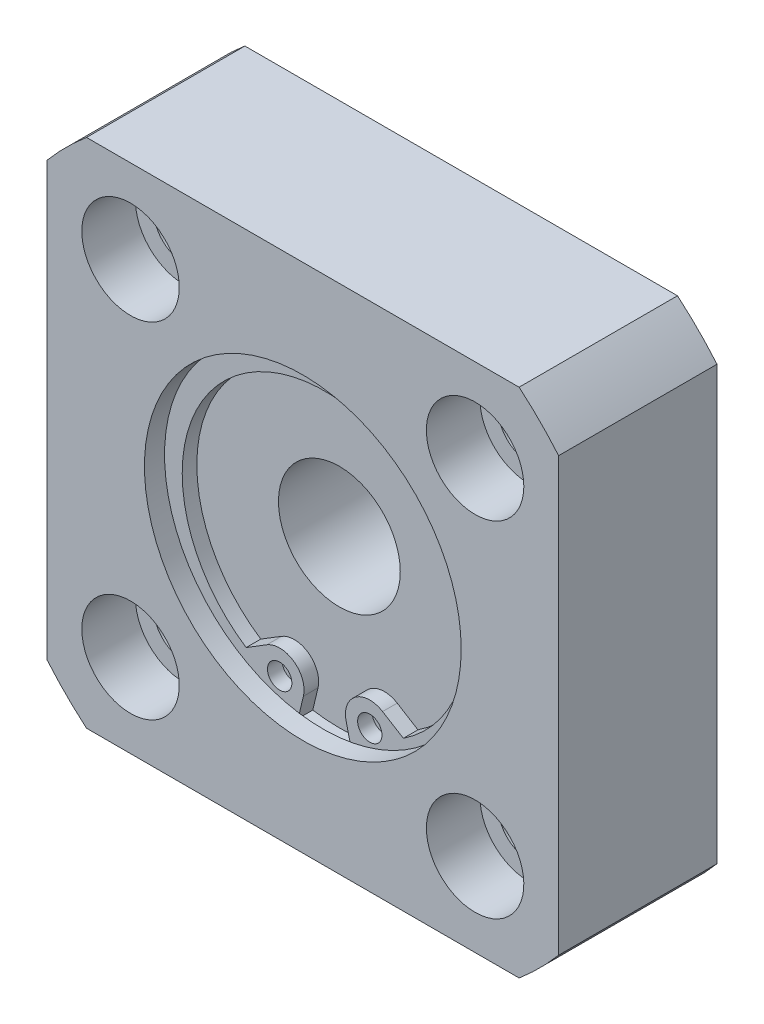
ISO-10303-21;
HEADER;
FILE_DESCRIPTION(('STEP AP214'),'2;1');
FILE_NAME('part.step','',(''),(''),'','','');
FILE_SCHEMA(('AUTOMOTIVE_DESIGN { 1 0 10303 214 1 1 1 1 }'));
ENDSEC;
DATA;
#1=APPLICATION_CONTEXT('core data for automotive mechanical design processes');
#2=APPLICATION_PROTOCOL_DEFINITION('international standard','automotive_design',2000,#1);
#3=PRODUCT_CONTEXT('',#1,'mechanical');
#4=PRODUCT('Part','Part','',(#3));
#5=PRODUCT_RELATED_PRODUCT_CATEGORY('part','',(#4));
#6=PRODUCT_DEFINITION_FORMATION('','',#4);
#7=PRODUCT_DEFINITION_CONTEXT('part definition',#1,'design');
#8=PRODUCT_DEFINITION('design','',#6,#7);
#9=PRODUCT_DEFINITION_SHAPE('','',#8);
#10=(LENGTH_UNIT() NAMED_UNIT(*) SI_UNIT(.MILLI.,.METRE.));
#11=(NAMED_UNIT(*) PLANE_ANGLE_UNIT() SI_UNIT($,.RADIAN.));
#12=(NAMED_UNIT(*) SI_UNIT($,.STERADIAN.) SOLID_ANGLE_UNIT());
#13=UNCERTAINTY_MEASURE_WITH_UNIT(LENGTH_MEASURE(1.E-05),#10,'distance_accuracy_value','');
#14=(GEOMETRIC_REPRESENTATION_CONTEXT(3) GLOBAL_UNCERTAINTY_ASSIGNED_CONTEXT((#13)) GLOBAL_UNIT_ASSIGNED_CONTEXT((#10,
#11,#12)) REPRESENTATION_CONTEXT('',''));
#15=CARTESIAN_POINT('',(0.,0.,0.));
#16=DIRECTION('',(0.,0.,1.));
#17=DIRECTION('',(1.,0.,0.));
#18=AXIS2_PLACEMENT_3D('',#15,#16,#17);
#19=CARTESIAN_POINT('',(14.1421356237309,14.142135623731,0.));
#20=DIRECTION('',(0.,0.,1.));
#21=DIRECTION('',(1.,0.,0.));
#22=AXIS2_PLACEMENT_3D('',#19,#20,#21);
#23=CYLINDRICAL_SURFACE('',#22,2.5);
#24=CARTESIAN_POINT('',(14.1421356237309,14.142135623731,0.));
#25=DIRECTION('',(0.,0.,1.));
#26=DIRECTION('',(1.,0.,0.));
#27=AXIS2_PLACEMENT_3D('',#24,#25,#26);
#28=CIRCLE('',#27,2.5);
#29=CARTESIAN_POINT('',(16.6421356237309,14.142135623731,0.));
#30=VERTEX_POINT('',#29);
#31=EDGE_CURVE('E203',#30,#30,#28,.T.);
#32=ORIENTED_EDGE('',*,*,#31,.F.);
#33=EDGE_LOOP('',(#32));
#34=FACE_BOUND('',#33,.T.);
#35=CARTESIAN_POINT('',(14.1421356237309,14.142135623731,8.6));
#36=DIRECTION('',(0.,0.,1.));
#37=DIRECTION('',(1.,0.,0.));
#38=AXIS2_PLACEMENT_3D('',#35,#36,#37);
#39=CIRCLE('',#38,2.5);
#40=CARTESIAN_POINT('',(16.6421356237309,14.142135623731,8.6));
#41=VERTEX_POINT('',#40);
#42=EDGE_CURVE('E200',#41,#41,#39,.F.);
#43=ORIENTED_EDGE('',*,*,#42,.F.);
#44=EDGE_LOOP('',(#43));
#45=FACE_BOUND('',#44,.T.);
#46=ADVANCED_FACE('F14',(#34,#45),#23,.F.);
#47=CARTESIAN_POINT('',(14.142135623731,-14.1421356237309,0.));
#48=DIRECTION('',(0.,0.,1.));
#49=DIRECTION('',(1.,0.,0.));
#50=AXIS2_PLACEMENT_3D('',#47,#48,#49);
#51=CYLINDRICAL_SURFACE('',#50,2.5);
#52=CARTESIAN_POINT('',(14.142135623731,-14.1421356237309,0.));
#53=DIRECTION('',(0.,0.,1.));
#54=DIRECTION('',(0.,-1.,0.));
#55=AXIS2_PLACEMENT_3D('',#52,#53,#54);
#56=CIRCLE('',#55,2.5);
#57=CARTESIAN_POINT('',(14.142135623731,-16.6421356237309,0.));
#58=VERTEX_POINT('',#57);
#59=EDGE_CURVE('E275',#58,#58,#56,.T.);
#60=ORIENTED_EDGE('',*,*,#59,.F.);
#61=EDGE_LOOP('',(#60));
#62=FACE_BOUND('',#61,.T.);
#63=CARTESIAN_POINT('',(14.142135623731,-14.1421356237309,8.6));
#64=DIRECTION('',(0.,0.,1.));
#65=DIRECTION('',(1.,0.,0.));
#66=AXIS2_PLACEMENT_3D('',#63,#64,#65);
#67=CIRCLE('',#66,2.5);
#68=CARTESIAN_POINT('',(16.642135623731,-14.1421356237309,8.6));
#69=VERTEX_POINT('',#68);
#70=EDGE_CURVE('E195',#69,#69,#67,.F.);
#71=ORIENTED_EDGE('',*,*,#70,.F.);
#72=EDGE_LOOP('',(#71));
#73=FACE_BOUND('',#72,.T.);
#74=ADVANCED_FACE('F419',(#62,#73),#51,.F.);
#75=CARTESIAN_POINT('',(-14.142135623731,-14.1421356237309,0.));
#76=DIRECTION('',(0.,0.,1.));
#77=DIRECTION('',(1.,0.,0.));
#78=AXIS2_PLACEMENT_3D('',#75,#76,#77);
#79=CYLINDRICAL_SURFACE('',#78,2.5);
#80=CARTESIAN_POINT('',(-14.142135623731,-14.1421356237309,0.));
#81=DIRECTION('',(0.,0.,1.));
#82=DIRECTION('',(-1.,0.,0.));
#83=AXIS2_PLACEMENT_3D('',#80,#81,#82);
#84=CIRCLE('',#83,2.5);
#85=CARTESIAN_POINT('',(-16.642135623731,-14.1421356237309,0.));
#86=VERTEX_POINT('',#85);
#87=EDGE_CURVE('E278',#86,#86,#84,.T.);
#88=ORIENTED_EDGE('',*,*,#87,.F.);
#89=EDGE_LOOP('',(#88));
#90=FACE_BOUND('',#89,.T.);
#91=CARTESIAN_POINT('',(-14.142135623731,-14.1421356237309,8.6));
#92=DIRECTION('',(0.,0.,1.));
#93=DIRECTION('',(1.,0.,0.));
#94=AXIS2_PLACEMENT_3D('',#91,#92,#93);
#95=CIRCLE('',#94,2.5);
#96=CARTESIAN_POINT('',(-11.642135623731,-14.1421356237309,8.6));
#97=VERTEX_POINT('',#96);
#98=EDGE_CURVE('E190',#97,#97,#95,.F.);
#99=ORIENTED_EDGE('',*,*,#98,.F.);
#100=EDGE_LOOP('',(#99));
#101=FACE_BOUND('',#100,.T.);
#102=ADVANCED_FACE('F425',(#90,#101),#79,.F.);
#103=CARTESIAN_POINT('',(-14.1421356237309,14.142135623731,0.));
#104=DIRECTION('',(0.,0.,1.));
#105=DIRECTION('',(1.,0.,0.));
#106=AXIS2_PLACEMENT_3D('',#103,#104,#105);
#107=CYLINDRICAL_SURFACE('',#106,2.5);
#108=CARTESIAN_POINT('',(-14.1421356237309,14.142135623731,0.));
#109=DIRECTION('',(0.,0.,1.));
#110=DIRECTION('',(0.,1.,0.));
#111=AXIS2_PLACEMENT_3D('',#108,#109,#110);
#112=CIRCLE('',#111,2.5);
#113=CARTESIAN_POINT('',(-14.1421356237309,16.642135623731,0.));
#114=VERTEX_POINT('',#113);
#115=EDGE_CURVE('E198',#114,#114,#112,.T.);
#116=ORIENTED_EDGE('',*,*,#115,.F.);
#117=EDGE_LOOP('',(#116));
#118=FACE_BOUND('',#117,.T.);
#119=CARTESIAN_POINT('',(-14.1421356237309,14.142135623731,8.6));
#120=DIRECTION('',(0.,0.,1.));
#121=DIRECTION('',(1.,0.,0.));
#122=AXIS2_PLACEMENT_3D('',#119,#120,#121);
#123=CIRCLE('',#122,2.5);
#124=CARTESIAN_POINT('',(-11.6421356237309,14.142135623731,8.6));
#125=VERTEX_POINT('',#124);
#126=EDGE_CURVE('E185',#125,#125,#123,.F.);
#127=ORIENTED_EDGE('',*,*,#126,.F.);
#128=EDGE_LOOP('',(#127));
#129=FACE_BOUND('',#128,.T.);
#130=ADVANCED_FACE('F531',(#118,#129),#107,.F.);
#131=CARTESIAN_POINT('',(14.1421356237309,14.142135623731,8.6));
#132=DIRECTION('',(0.,0.,1.));
#133=DIRECTION('',(1.,0.,0.));
#134=AXIS2_PLACEMENT_3D('',#131,#132,#133);
#135=PLANE('',#134);
#136=CARTESIAN_POINT('',(14.1421356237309,14.142135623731,8.6));
#137=DIRECTION('',(0.,0.,1.));
#138=DIRECTION('',(1.,0.,0.));
#139=AXIS2_PLACEMENT_3D('',#136,#137,#138);
#140=CIRCLE('',#139,4.);
#141=CARTESIAN_POINT('',(18.1421356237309,14.142135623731,8.6));
#142=VERTEX_POINT('',#141);
#143=EDGE_CURVE('E204',#142,#142,#140,.T.);
#144=ORIENTED_EDGE('',*,*,#143,.T.);
#145=EDGE_LOOP('',(#144));
#146=FACE_BOUND('',#145,.T.);
#147=ORIENTED_EDGE('',*,*,#42,.T.);
#148=EDGE_LOOP('',(#147));
#149=FACE_BOUND('',#148,.T.);
#150=ADVANCED_FACE('F526',(#146,#149),#135,.T.);
#151=CARTESIAN_POINT('',(14.142135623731,-14.1421356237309,8.6));
#152=DIRECTION('',(0.,0.,1.));
#153=DIRECTION('',(1.,0.,0.));
#154=AXIS2_PLACEMENT_3D('',#151,#152,#153);
#155=PLANE('',#154);
#156=CARTESIAN_POINT('',(14.142135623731,-14.1421356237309,8.6));
#157=DIRECTION('',(0.,0.,1.));
#158=DIRECTION('',(0.,-1.,0.));
#159=AXIS2_PLACEMENT_3D('',#156,#157,#158);
#160=CIRCLE('',#159,4.);
#161=CARTESIAN_POINT('',(14.142135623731,-18.1421356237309,8.6));
#162=VERTEX_POINT('',#161);
#163=EDGE_CURVE('E199',#162,#162,#160,.T.);
#164=ORIENTED_EDGE('',*,*,#163,.T.);
#165=EDGE_LOOP('',(#164));
#166=FACE_BOUND('',#165,.T.);
#167=ORIENTED_EDGE('',*,*,#70,.T.);
#168=EDGE_LOOP('',(#167));
#169=FACE_BOUND('',#168,.T.);
#170=ADVANCED_FACE('F518',(#166,#169),#155,.T.);
#171=CARTESIAN_POINT('',(-14.142135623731,-14.1421356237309,8.6));
#172=DIRECTION('',(0.,0.,1.));
#173=DIRECTION('',(1.,0.,0.));
#174=AXIS2_PLACEMENT_3D('',#171,#172,#173);
#175=PLANE('',#174);
#176=CARTESIAN_POINT('',(-14.142135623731,-14.1421356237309,8.6));
#177=DIRECTION('',(0.,0.,1.));
#178=DIRECTION('',(-1.,0.,0.));
#179=AXIS2_PLACEMENT_3D('',#176,#177,#178);
#180=CIRCLE('',#179,4.);
#181=CARTESIAN_POINT('',(-18.142135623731,-14.1421356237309,8.6));
#182=VERTEX_POINT('',#181);
#183=EDGE_CURVE('E194',#182,#182,#180,.T.);
#184=ORIENTED_EDGE('',*,*,#183,.T.);
#185=EDGE_LOOP('',(#184));
#186=FACE_BOUND('',#185,.T.);
#187=ORIENTED_EDGE('',*,*,#98,.T.);
#188=EDGE_LOOP('',(#187));
#189=FACE_BOUND('',#188,.T.);
#190=ADVANCED_FACE('F510',(#186,#189),#175,.T.);
#191=CARTESIAN_POINT('',(-14.1421356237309,14.142135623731,8.6));
#192=DIRECTION('',(0.,0.,1.));
#193=DIRECTION('',(1.,0.,0.));
#194=AXIS2_PLACEMENT_3D('',#191,#192,#193);
#195=PLANE('',#194);
#196=CARTESIAN_POINT('',(-14.1421356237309,14.142135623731,8.6));
#197=DIRECTION('',(0.,0.,1.));
#198=DIRECTION('',(0.,1.,0.));
#199=AXIS2_PLACEMENT_3D('',#196,#197,#198);
#200=CIRCLE('',#199,4.);
#201=CARTESIAN_POINT('',(-14.1421356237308,18.142135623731,8.6));
#202=VERTEX_POINT('',#201);
#203=EDGE_CURVE('E189',#202,#202,#200,.T.);
#204=ORIENTED_EDGE('',*,*,#203,.T.);
#205=EDGE_LOOP('',(#204));
#206=FACE_BOUND('',#205,.T.);
#207=ORIENTED_EDGE('',*,*,#126,.T.);
#208=EDGE_LOOP('',(#207));
#209=FACE_BOUND('',#208,.T.);
#210=ADVANCED_FACE('F440',(#206,#209),#195,.T.);
#211=CARTESIAN_POINT('',(0.,0.,0.));
#212=DIRECTION('',(0.,0.,-1.));
#213=DIRECTION('',(-1.,0.,0.));
#214=AXIS2_PLACEMENT_3D('',#211,#212,#213);
#215=PLANE('',#214);
#216=CARTESIAN_POINT('',(0.,0.,0.));
#217=DIRECTION('',(0.,0.,-1.));
#218=DIRECTION('',(-1.,0.,0.));
#219=AXIS2_PLACEMENT_3D('',#216,#217,#218);
#220=CIRCLE('',#219,11.);
#221=CARTESIAN_POINT('',(-11.,0.,0.));
#222=VERTEX_POINT('',#221);
#223=EDGE_CURVE('E174',#222,#222,#220,.T.);
#224=ORIENTED_EDGE('',*,*,#223,.F.);
#225=EDGE_LOOP('',(#224));
#226=FACE_BOUND('',#225,.T.);
#227=ORIENTED_EDGE('',*,*,#115,.T.);
#228=EDGE_LOOP('',(#227));
#229=FACE_BOUND('',#228,.T.);
#230=ORIENTED_EDGE('',*,*,#87,.T.);
#231=EDGE_LOOP('',(#230));
#232=FACE_BOUND('',#231,.T.);
#233=ORIENTED_EDGE('',*,*,#59,.T.);
#234=EDGE_LOOP('',(#233));
#235=FACE_BOUND('',#234,.T.);
#236=ORIENTED_EDGE('',*,*,#31,.T.);
#237=EDGE_LOOP('',(#236));
#238=FACE_BOUND('',#237,.T.);
#239=CARTESIAN_POINT('',(0.,0.,0.));
#240=DIRECTION('',(0.,0.,-1.));
#241=DIRECTION('',(-1.,0.,0.));
#242=AXIS2_PLACEMENT_3D('',#239,#240,#241);
#243=CIRCLE('',#242,27.5);
#244=CARTESIAN_POINT('',(21.,-17.7552809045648,0.));
#245=VERTEX_POINT('',#244);
#246=CARTESIAN_POINT('',(17.7552809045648,-21.,0.));
#247=VERTEX_POINT('',#246);
#248=EDGE_CURVE('E262',#245,#247,#243,.T.);
#249=ORIENTED_EDGE('',*,*,#248,.T.);
#250=DIRECTION('',(1.,0.,0.));
#251=VECTOR('',#250,1.);
#252=CARTESIAN_POINT('',(-17.7552809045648,-21.,0.));
#253=LINE('',#252,#251);
#254=CARTESIAN_POINT('',(-17.7552809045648,-21.,0.));
#255=VERTEX_POINT('',#254);
#256=EDGE_CURVE('E265',#255,#247,#253,.T.);
#257=ORIENTED_EDGE('',*,*,#256,.F.);
#258=CARTESIAN_POINT('',(0.,0.,0.));
#259=DIRECTION('',(0.,0.,1.));
#260=DIRECTION('',(1.,0.,0.));
#261=AXIS2_PLACEMENT_3D('',#258,#259,#260);
#262=CIRCLE('',#261,27.5);
#263=CARTESIAN_POINT('',(-21.,-17.7552809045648,0.));
#264=VERTEX_POINT('',#263);
#265=EDGE_CURVE('E255',#264,#255,#262,.T.);
#266=ORIENTED_EDGE('',*,*,#265,.F.);
#267=DIRECTION('',(0.,1.,0.));
#268=VECTOR('',#267,1.);
#269=CARTESIAN_POINT('',(-21.,-17.7552809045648,0.));
#270=LINE('',#269,#268);
#271=CARTESIAN_POINT('',(-21.,17.7552809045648,0.));
#272=VERTEX_POINT('',#271);
#273=EDGE_CURVE('E261',#264,#272,#270,.T.);
#274=ORIENTED_EDGE('',*,*,#273,.T.);
#275=CARTESIAN_POINT('',(-17.7552809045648,21.,0.));
#276=VERTEX_POINT('',#275);
#277=EDGE_CURVE('E258',#272,#276,#243,.T.);
#278=ORIENTED_EDGE('',*,*,#277,.T.);
#279=DIRECTION('',(1.,0.,0.));
#280=VECTOR('',#279,1.);
#281=CARTESIAN_POINT('',(-17.7552809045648,21.,0.));
#282=LINE('',#281,#280);
#283=CARTESIAN_POINT('',(17.7552809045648,21.,0.));
#284=VERTEX_POINT('',#283);
#285=EDGE_CURVE('E254',#276,#284,#282,.T.);
#286=ORIENTED_EDGE('',*,*,#285,.T.);
#287=CARTESIAN_POINT('',(21.,17.7552809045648,0.));
#288=VERTEX_POINT('',#287);
#289=EDGE_CURVE('E251',#288,#284,#262,.T.);
#290=ORIENTED_EDGE('',*,*,#289,.F.);
#291=DIRECTION('',(0.,1.,0.));
#292=VECTOR('',#291,1.);
#293=CARTESIAN_POINT('',(21.,-17.7552809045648,0.));
#294=LINE('',#293,#292);
#295=EDGE_CURVE('E248',#245,#288,#294,.T.);
#296=ORIENTED_EDGE('',*,*,#295,.F.);
#297=EDGE_LOOP('',(#249,#257,#266,#274,#278,#286,#290,#296));
#298=FACE_BOUND('',#297,.T.);
#299=ADVANCED_FACE('F437',(#226,#229,#232,#235,#238,#298),#215,.T.);
#300=CARTESIAN_POINT('',(-17.7552809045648,-21.,13.));
#301=DIRECTION('',(0.,1.,0.));
#302=DIRECTION('',(0.,0.,1.));
#303=AXIS2_PLACEMENT_3D('',#300,#301,#302);
#304=PLANE('',#303);
#305=DIRECTION('',(1.,0.,0.));
#306=VECTOR('',#305,1.);
#307=CARTESIAN_POINT('',(-17.7552809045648,-21.,13.));
#308=LINE('',#307,#306);
#309=CARTESIAN_POINT('',(-17.7552809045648,-21.,13.));
#310=VERTEX_POINT('',#309);
#311=CARTESIAN_POINT('',(17.7552809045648,-21.,13.));
#312=VERTEX_POINT('',#311);
#313=EDGE_CURVE('E245',#310,#312,#308,.T.);
#314=ORIENTED_EDGE('',*,*,#313,.F.);
#315=DIRECTION('',(0.,0.,-1.));
#316=VECTOR('',#315,1.);
#317=CARTESIAN_POINT('',(-17.7552809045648,-21.,13.));
#318=LINE('',#317,#316);
#319=EDGE_CURVE('E222',#310,#255,#318,.T.);
#320=ORIENTED_EDGE('',*,*,#319,.T.);
#321=ORIENTED_EDGE('',*,*,#256,.T.);
#322=DIRECTION('',(0.,0.,-1.));
#323=VECTOR('',#322,1.);
#324=CARTESIAN_POINT('',(17.7552809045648,-21.,13.));
#325=LINE('',#324,#323);
#326=EDGE_CURVE('E225',#312,#247,#325,.T.);
#327=ORIENTED_EDGE('',*,*,#326,.F.);
#328=EDGE_LOOP('',(#314,#320,#321,#327));
#329=FACE_BOUND('',#328,.T.);
#330=ADVANCED_FACE('F439',(#329),#304,.F.);
#331=CARTESIAN_POINT('',(0.,0.,13.));
#332=DIRECTION('',(0.,0.,-1.));
#333=DIRECTION('',(-1.,0.,0.));
#334=AXIS2_PLACEMENT_3D('',#331,#332,#333);
#335=CYLINDRICAL_SURFACE('',#334,27.5);
#336=ORIENTED_EDGE('',*,*,#319,.F.);
#337=CARTESIAN_POINT('',(0.,0.,13.));
#338=DIRECTION('',(0.,0.,1.));
#339=DIRECTION('',(1.,0.,0.));
#340=AXIS2_PLACEMENT_3D('',#337,#338,#339);
#341=CIRCLE('',#340,27.5);
#342=CARTESIAN_POINT('',(-21.,-17.7552809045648,13.));
#343=VERTEX_POINT('',#342);
#344=EDGE_CURVE('E235',#343,#310,#341,.T.);
#345=ORIENTED_EDGE('',*,*,#344,.F.);
#346=DIRECTION('',(0.,0.,-1.));
#347=VECTOR('',#346,1.);
#348=CARTESIAN_POINT('',(-21.,-17.7552809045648,13.));
#349=LINE('',#348,#347);
#350=EDGE_CURVE('E219',#343,#264,#349,.T.);
#351=ORIENTED_EDGE('',*,*,#350,.T.);
#352=ORIENTED_EDGE('',*,*,#265,.T.);
#353=EDGE_LOOP('',(#336,#345,#351,#352));
#354=FACE_BOUND('',#353,.T.);
#355=ADVANCED_FACE('F449',(#354),#335,.T.);
#356=CARTESIAN_POINT('',(-21.,-17.7552809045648,13.));
#357=DIRECTION('',(-1.,0.,0.));
#358=DIRECTION('',(0.,0.,1.));
#359=AXIS2_PLACEMENT_3D('',#356,#357,#358);
#360=PLANE('',#359);
#361=ORIENTED_EDGE('',*,*,#350,.F.);
#362=DIRECTION('',(0.,1.,0.));
#363=VECTOR('',#362,1.);
#364=CARTESIAN_POINT('',(-21.,-17.7552809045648,13.));
#365=LINE('',#364,#363);
#366=CARTESIAN_POINT('',(-21.,17.7552809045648,13.));
#367=VERTEX_POINT('',#366);
#368=EDGE_CURVE('E241',#343,#367,#365,.T.);
#369=ORIENTED_EDGE('',*,*,#368,.T.);
#370=DIRECTION('',(0.,0.,-1.));
#371=VECTOR('',#370,1.);
#372=CARTESIAN_POINT('',(-21.,17.7552809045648,13.));
#373=LINE('',#372,#371);
#374=EDGE_CURVE('E216',#367,#272,#373,.T.);
#375=ORIENTED_EDGE('',*,*,#374,.T.);
#376=ORIENTED_EDGE('',*,*,#273,.F.);
#377=EDGE_LOOP('',(#361,#369,#375,#376));
#378=FACE_BOUND('',#377,.T.);
#379=ADVANCED_FACE('F453',(#378),#360,.T.);
#380=CARTESIAN_POINT('',(0.,0.,13.));
#381=DIRECTION('',(0.,0.,-1.));
#382=DIRECTION('',(-1.,0.,0.));
#383=AXIS2_PLACEMENT_3D('',#380,#381,#382);
#384=CYLINDRICAL_SURFACE('',#383,27.5);
#385=ORIENTED_EDGE('',*,*,#374,.F.);
#386=CARTESIAN_POINT('',(0.,0.,13.));
#387=DIRECTION('',(0.,0.,-1.));
#388=DIRECTION('',(-1.,0.,0.));
#389=AXIS2_PLACEMENT_3D('',#386,#387,#388);
#390=CIRCLE('',#389,27.5);
#391=CARTESIAN_POINT('',(-17.7552809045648,21.,13.));
#392=VERTEX_POINT('',#391);
#393=EDGE_CURVE('E238',#367,#392,#390,.T.);
#394=ORIENTED_EDGE('',*,*,#393,.T.);
#395=DIRECTION('',(0.,0.,-1.));
#396=VECTOR('',#395,1.);
#397=CARTESIAN_POINT('',(-17.7552809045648,21.,13.));
#398=LINE('',#397,#396);
#399=EDGE_CURVE('E213',#392,#276,#398,.T.);
#400=ORIENTED_EDGE('',*,*,#399,.T.);
#401=ORIENTED_EDGE('',*,*,#277,.F.);
#402=EDGE_LOOP('',(#385,#394,#400,#401));
#403=FACE_BOUND('',#402,.T.);
#404=ADVANCED_FACE('F446',(#403),#384,.T.);
#405=CARTESIAN_POINT('',(-17.7552809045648,21.,13.));
#406=DIRECTION('',(0.,1.,0.));
#407=DIRECTION('',(0.,0.,1.));
#408=AXIS2_PLACEMENT_3D('',#405,#406,#407);
#409=PLANE('',#408);
#410=ORIENTED_EDGE('',*,*,#399,.F.);
#411=DIRECTION('',(1.,0.,0.));
#412=VECTOR('',#411,1.);
#413=CARTESIAN_POINT('',(-17.7552809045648,21.,13.));
#414=LINE('',#413,#412);
#415=CARTESIAN_POINT('',(17.7552809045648,21.,13.));
#416=VERTEX_POINT('',#415);
#417=EDGE_CURVE('E234',#392,#416,#414,.T.);
#418=ORIENTED_EDGE('',*,*,#417,.T.);
#419=DIRECTION('',(0.,0.,-1.));
#420=VECTOR('',#419,1.);
#421=CARTESIAN_POINT('',(17.7552809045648,21.,13.));
#422=LINE('',#421,#420);
#423=EDGE_CURVE('E210',#416,#284,#422,.T.);
#424=ORIENTED_EDGE('',*,*,#423,.T.);
#425=ORIENTED_EDGE('',*,*,#285,.F.);
#426=EDGE_LOOP('',(#410,#418,#424,#425));
#427=FACE_BOUND('',#426,.T.);
#428=ADVANCED_FACE('F458',(#427),#409,.T.);
#429=ORIENTED_EDGE('',*,*,#423,.F.);
#430=CARTESIAN_POINT('',(21.,17.7552809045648,13.));
#431=VERTEX_POINT('',#430);
#432=EDGE_CURVE('E231',#431,#416,#341,.T.);
#433=ORIENTED_EDGE('',*,*,#432,.F.);
#434=DIRECTION('',(0.,0.,-1.));
#435=VECTOR('',#434,1.);
#436=CARTESIAN_POINT('',(21.,17.7552809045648,13.));
#437=LINE('',#436,#435);
#438=EDGE_CURVE('E207',#431,#288,#437,.T.);
#439=ORIENTED_EDGE('',*,*,#438,.T.);
#440=ORIENTED_EDGE('',*,*,#289,.T.);
#441=EDGE_LOOP('',(#429,#433,#439,#440));
#442=FACE_BOUND('',#441,.T.);
#443=ADVANCED_FACE('F363',(#442),#335,.T.);
#444=CARTESIAN_POINT('',(21.,-17.7552809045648,13.));
#445=DIRECTION('',(-1.,0.,0.));
#446=DIRECTION('',(0.,0.,1.));
#447=AXIS2_PLACEMENT_3D('',#444,#445,#446);
#448=PLANE('',#447);
#449=ORIENTED_EDGE('',*,*,#438,.F.);
#450=DIRECTION('',(0.,1.,0.));
#451=VECTOR('',#450,1.);
#452=CARTESIAN_POINT('',(21.,-17.7552809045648,13.));
#453=LINE('',#452,#451);
#454=CARTESIAN_POINT('',(21.,-17.7552809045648,13.));
#455=VERTEX_POINT('',#454);
#456=EDGE_CURVE('E228',#455,#431,#453,.T.);
#457=ORIENTED_EDGE('',*,*,#456,.F.);
#458=DIRECTION('',(0.,0.,-1.));
#459=VECTOR('',#458,1.);
#460=CARTESIAN_POINT('',(21.,-17.7552809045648,13.));
#461=LINE('',#460,#459);
#462=EDGE_CURVE('E170',#455,#245,#461,.T.);
#463=ORIENTED_EDGE('',*,*,#462,.T.);
#464=ORIENTED_EDGE('',*,*,#295,.T.);
#465=EDGE_LOOP('',(#449,#457,#463,#464));
#466=FACE_BOUND('',#465,.T.);
#467=ADVANCED_FACE('F352',(#466),#448,.F.);
#468=ORIENTED_EDGE('',*,*,#462,.F.);
#469=EDGE_CURVE('E242',#455,#312,#390,.T.);
#470=ORIENTED_EDGE('',*,*,#469,.T.);
#471=ORIENTED_EDGE('',*,*,#326,.T.);
#472=ORIENTED_EDGE('',*,*,#248,.F.);
#473=EDGE_LOOP('',(#468,#470,#471,#472));
#474=FACE_BOUND('',#473,.T.);
#475=ADVANCED_FACE('F443',(#474),#384,.T.);
#476=CARTESIAN_POINT('',(14.1421356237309,14.142135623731,8.6));
#477=DIRECTION('',(0.,0.,1.));
#478=DIRECTION('',(1.,0.,0.));
#479=AXIS2_PLACEMENT_3D('',#476,#477,#478);
#480=CYLINDRICAL_SURFACE('',#479,4.);
#481=ORIENTED_EDGE('',*,*,#143,.F.);
#482=EDGE_LOOP('',(#481));
#483=FACE_BOUND('',#482,.T.);
#484=CARTESIAN_POINT('',(14.1421356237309,14.142135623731,13.));
#485=DIRECTION('',(0.,0.,1.));
#486=DIRECTION('',(1.,0.,0.));
#487=AXIS2_PLACEMENT_3D('',#484,#485,#486);
#488=CIRCLE('',#487,4.);
#489=CARTESIAN_POINT('',(18.1421356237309,14.142135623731,13.));
#490=VERTEX_POINT('',#489);
#491=EDGE_CURVE('E272',#490,#490,#488,.T.);
#492=ORIENTED_EDGE('',*,*,#491,.T.);
#493=EDGE_LOOP('',(#492));
#494=FACE_BOUND('',#493,.T.);
#495=ADVANCED_FACE('F432',(#483,#494),#480,.F.);
#496=CARTESIAN_POINT('',(14.142135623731,-14.1421356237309,8.6));
#497=DIRECTION('',(0.,0.,1.));
#498=DIRECTION('',(1.,0.,0.));
#499=AXIS2_PLACEMENT_3D('',#496,#497,#498);
#500=CYLINDRICAL_SURFACE('',#499,4.);
#501=ORIENTED_EDGE('',*,*,#163,.F.);
#502=EDGE_LOOP('',(#501));
#503=FACE_BOUND('',#502,.T.);
#504=CARTESIAN_POINT('',(14.142135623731,-14.1421356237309,13.));
#505=DIRECTION('',(0.,0.,1.));
#506=DIRECTION('',(0.,-1.,0.));
#507=AXIS2_PLACEMENT_3D('',#504,#505,#506);
#508=CIRCLE('',#507,4.);
#509=CARTESIAN_POINT('',(14.142135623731,-18.1421356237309,13.));
#510=VERTEX_POINT('',#509);
#511=EDGE_CURVE('E193',#510,#510,#508,.T.);
#512=ORIENTED_EDGE('',*,*,#511,.T.);
#513=EDGE_LOOP('',(#512));
#514=FACE_BOUND('',#513,.T.);
#515=ADVANCED_FACE('F522',(#503,#514),#500,.F.);
#516=CARTESIAN_POINT('',(-14.142135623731,-14.1421356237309,8.6));
#517=DIRECTION('',(0.,0.,1.));
#518=DIRECTION('',(1.,0.,0.));
#519=AXIS2_PLACEMENT_3D('',#516,#517,#518);
#520=CYLINDRICAL_SURFACE('',#519,4.);
#521=ORIENTED_EDGE('',*,*,#183,.F.);
#522=EDGE_LOOP('',(#521));
#523=FACE_BOUND('',#522,.T.);
#524=CARTESIAN_POINT('',(-14.142135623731,-14.1421356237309,13.));
#525=DIRECTION('',(0.,0.,1.));
#526=DIRECTION('',(-1.,0.,0.));
#527=AXIS2_PLACEMENT_3D('',#524,#525,#526);
#528=CIRCLE('',#527,4.);
#529=CARTESIAN_POINT('',(-18.142135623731,-14.1421356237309,13.));
#530=VERTEX_POINT('',#529);
#531=EDGE_CURVE('E188',#530,#530,#528,.T.);
#532=ORIENTED_EDGE('',*,*,#531,.T.);
#533=EDGE_LOOP('',(#532));
#534=FACE_BOUND('',#533,.T.);
#535=ADVANCED_FACE('F514',(#523,#534),#520,.F.);
#536=CARTESIAN_POINT('',(-14.1421356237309,14.142135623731,8.6));
#537=DIRECTION('',(0.,0.,1.));
#538=DIRECTION('',(1.,0.,0.));
#539=AXIS2_PLACEMENT_3D('',#536,#537,#538);
#540=CYLINDRICAL_SURFACE('',#539,4.);
#541=ORIENTED_EDGE('',*,*,#203,.F.);
#542=EDGE_LOOP('',(#541));
#543=FACE_BOUND('',#542,.T.);
#544=CARTESIAN_POINT('',(-14.1421356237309,14.142135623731,13.));
#545=DIRECTION('',(0.,0.,1.));
#546=DIRECTION('',(0.,1.,0.));
#547=AXIS2_PLACEMENT_3D('',#544,#545,#546);
#548=CIRCLE('',#547,4.);
#549=CARTESIAN_POINT('',(-14.1421356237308,18.142135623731,13.));
#550=VERTEX_POINT('',#549);
#551=EDGE_CURVE('E184',#550,#550,#548,.T.);
#552=ORIENTED_EDGE('',*,*,#551,.T.);
#553=EDGE_LOOP('',(#552));
#554=FACE_BOUND('',#553,.T.);
#555=ADVANCED_FACE('F503',(#543,#554),#540,.F.);
#556=CARTESIAN_POINT('',(0.,0.,2.));
#557=DIRECTION('',(0.,0.,-1.));
#558=DIRECTION('',(-1.,0.,0.));
#559=AXIS2_PLACEMENT_3D('',#556,#557,#558);
#560=CYLINDRICAL_SURFACE('',#559,11.);
#561=CARTESIAN_POINT('',(0.,0.,2.));
#562=DIRECTION('',(0.,0.,-1.));
#563=DIRECTION('',(-1.,0.,0.));
#564=AXIS2_PLACEMENT_3D('',#561,#562,#563);
#565=CIRCLE('',#564,11.);
#566=CARTESIAN_POINT('',(-11.,0.,2.));
#567=VERTEX_POINT('',#566);
#568=EDGE_CURVE('E180',#567,#567,#565,.T.);
#569=ORIENTED_EDGE('',*,*,#568,.F.);
#570=EDGE_LOOP('',(#569));
#571=FACE_BOUND('',#570,.T.);
#572=ORIENTED_EDGE('',*,*,#223,.T.);
#573=EDGE_LOOP('',(#572));
#574=FACE_BOUND('',#573,.T.);
#575=ADVANCED_FACE('F328',(#571,#574),#560,.F.);
#576=CARTESIAN_POINT('',(0.,0.,13.));
#577=DIRECTION('',(0.,0.,-1.));
#578=DIRECTION('',(-1.,0.,0.));
#579=AXIS2_PLACEMENT_3D('',#576,#577,#578);
#580=PLANE('',#579);
#581=CARTESIAN_POINT('',(0.,0.,13.));
#582=DIRECTION('',(0.,0.,1.));
#583=DIRECTION('',(1.,0.,0.));
#584=AXIS2_PLACEMENT_3D('',#581,#582,#583);
#585=CIRCLE('',#584,13.);
#586=CARTESIAN_POINT('',(13.,0.,13.));
#587=VERTEX_POINT('',#586);
#588=EDGE_CURVE('E179',#587,#587,#585,.T.);
#589=ORIENTED_EDGE('',*,*,#588,.F.);
#590=EDGE_LOOP('',(#589));
#591=FACE_BOUND('',#590,.T.);
#592=ORIENTED_EDGE('',*,*,#551,.F.);
#593=EDGE_LOOP('',(#592));
#594=FACE_BOUND('',#593,.T.);
#595=ORIENTED_EDGE('',*,*,#531,.F.);
#596=EDGE_LOOP('',(#595));
#597=FACE_BOUND('',#596,.T.);
#598=ORIENTED_EDGE('',*,*,#511,.F.);
#599=EDGE_LOOP('',(#598));
#600=FACE_BOUND('',#599,.T.);
#601=ORIENTED_EDGE('',*,*,#491,.F.);
#602=EDGE_LOOP('',(#601));
#603=FACE_BOUND('',#602,.T.);
#604=ORIENTED_EDGE('',*,*,#469,.F.);
#605=ORIENTED_EDGE('',*,*,#456,.T.);
#606=ORIENTED_EDGE('',*,*,#432,.T.);
#607=ORIENTED_EDGE('',*,*,#417,.F.);
#608=ORIENTED_EDGE('',*,*,#393,.F.);
#609=ORIENTED_EDGE('',*,*,#368,.F.);
#610=ORIENTED_EDGE('',*,*,#344,.T.);
#611=ORIENTED_EDGE('',*,*,#313,.T.);
#612=EDGE_LOOP('',(#604,#605,#606,#607,#608,#609,#610,#611));
#613=FACE_BOUND('',#612,.T.);
#614=ADVANCED_FACE('F325',(#591,#594,#597,#600,#603,#613),#580,.F.);
#615=CARTESIAN_POINT('',(0.,0.,2.));
#616=DIRECTION('',(0.,0.,-1.));
#617=DIRECTION('',(-1.,0.,0.));
#618=AXIS2_PLACEMENT_3D('',#615,#616,#617);
#619=PLANE('',#618);
#620=CARTESIAN_POINT('',(0.,0.,2.));
#621=DIRECTION('',(0.,0.,-1.));
#622=DIRECTION('',(-1.,0.,0.));
#623=AXIS2_PLACEMENT_3D('',#620,#621,#622);
#624=CIRCLE('',#623,5.);
#625=CARTESIAN_POINT('',(-5.,0.,2.));
#626=VERTEX_POINT('',#625);
#627=EDGE_CURVE('E176',#626,#626,#624,.T.);
#628=ORIENTED_EDGE('',*,*,#627,.F.);
#629=EDGE_LOOP('',(#628));
#630=FACE_BOUND('',#629,.T.);
#631=ORIENTED_EDGE('',*,*,#568,.T.);
#632=EDGE_LOOP('',(#631));
#633=FACE_BOUND('',#632,.T.);
#634=ADVANCED_FACE('F321',(#630,#633),#619,.T.);
#635=CARTESIAN_POINT('',(0.,0.,10.));
#636=DIRECTION('',(0.,0.,1.));
#637=DIRECTION('',(1.,0.,0.));
#638=AXIS2_PLACEMENT_3D('',#635,#636,#637);
#639=CYLINDRICAL_SURFACE('',#638,13.);
#640=CARTESIAN_POINT('',(0.,0.,11.35));
#641=DIRECTION('',(0.,0.,1.));
#642=DIRECTION('',(1.,0.,0.));
#643=AXIS2_PLACEMENT_3D('',#640,#641,#642);
#644=CIRCLE('',#643,13.);
#645=CARTESIAN_POINT('',(13.,0.,11.35));
#646=VERTEX_POINT('',#645);
#647=EDGE_CURVE('E171',#646,#646,#644,.F.);
#648=ORIENTED_EDGE('',*,*,#647,.T.);
#649=EDGE_LOOP('',(#648));
#650=FACE_BOUND('',#649,.T.);
#651=ORIENTED_EDGE('',*,*,#588,.T.);
#652=EDGE_LOOP('',(#651));
#653=FACE_BOUND('',#652,.T.);
#654=ADVANCED_FACE('F317',(#650,#653),#639,.F.);
#655=CARTESIAN_POINT('',(0.,0.,13.));
#656=DIRECTION('',(0.,0.,-1.));
#657=DIRECTION('',(-1.,0.,0.));
#658=AXIS2_PLACEMENT_3D('',#655,#656,#657);
#659=CYLINDRICAL_SURFACE('',#658,5.);
#660=CARTESIAN_POINT('',(0.,0.,10.));
#661=DIRECTION('',(0.,0.,1.));
#662=DIRECTION('',(1.,0.,0.));
#663=AXIS2_PLACEMENT_3D('',#660,#661,#662);
#664=CIRCLE('',#663,5.);
#665=CARTESIAN_POINT('',(5.,0.,10.));
#666=VERTEX_POINT('',#665);
#667=EDGE_CURVE('E181',#666,#666,#664,.T.);
#668=ORIENTED_EDGE('',*,*,#667,.T.);
#669=EDGE_LOOP('',(#668));
#670=FACE_BOUND('',#669,.T.);
#671=ORIENTED_EDGE('',*,*,#627,.T.);
#672=EDGE_LOOP('',(#671));
#673=FACE_BOUND('',#672,.T.);
#674=ADVANCED_FACE('F320',(#670,#673),#659,.F.);
#675=CARTESIAN_POINT('',(0.,0.,10.));
#676=DIRECTION('',(0.,0.,1.));
#677=DIRECTION('',(1.,0.,0.));
#678=AXIS2_PLACEMENT_3D('',#675,#676,#677);
#679=PLANE('',#678);
#680=ORIENTED_EDGE('',*,*,#667,.F.);
#681=EDGE_LOOP('',(#680));
#682=FACE_BOUND('',#681,.T.);
#683=CARTESIAN_POINT('',(0.,0.,10.));
#684=DIRECTION('',(0.,0.,1.));
#685=DIRECTION('',(1.,0.,0.));
#686=AXIS2_PLACEMENT_3D('',#683,#684,#685);
#687=CIRCLE('',#686,13.6);
#688=CARTESIAN_POINT('',(-2.18133072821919,-13.4239262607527,10.));
#689=VERTEX_POINT('',#688);
#690=CARTESIAN_POINT('',(2.1813307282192,-13.4239262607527,10.));
#691=VERTEX_POINT('',#690);
#692=EDGE_CURVE('E301',#689,#691,#687,.T.);
#693=ORIENTED_EDGE('',*,*,#692,.T.);
#694=DIRECTION('',(-0.231349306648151,0.972870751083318,0.));
#695=VECTOR('',#694,1.);
#696=CARTESIAN_POINT('',(-0.956782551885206,-0.227523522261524,10.));
#697=LINE('',#696,#695);
#698=CARTESIAN_POINT('',(1.75425849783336,-11.6280009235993,10.));
#699=VERTEX_POINT('',#698);
#700=EDGE_CURVE('E9',#691,#699,#697,.T.);
#701=ORIENTED_EDGE('',*,*,#700,.T.);
#702=CARTESIAN_POINT('',(3.7,-11.165302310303,10.));
#703=DIRECTION('',(0.,0.,1.));
#704=DIRECTION('',(1.,0.,0.));
#705=AXIS2_PLACEMENT_3D('',#702,#703,#704);
#706=CIRCLE('',#705,2.);
#707=CARTESIAN_POINT('',(4.74866968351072,-9.46227797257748,10.));
#708=VERTEX_POINT('',#707);
#709=EDGE_CURVE('E25',#708,#699,#706,.T.);
#710=ORIENTED_EDGE('',*,*,#709,.F.);
#711=DIRECTION('',(0.851512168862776,-0.524334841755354,0.));
#712=VECTOR('',#711,1.);
#713=CARTESIAN_POINT('',(-2.91915656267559,-4.74066786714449,10.));
#714=LINE('',#713,#712);
#715=CARTESIAN_POINT('',(6.45127454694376,-10.5106893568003,10.));
#716=VERTEX_POINT('',#715);
#717=EDGE_CURVE('E138',#708,#716,#714,.T.);
#718=ORIENTED_EDGE('',*,*,#717,.T.);
#719=CARTESIAN_POINT('',(0.,-0.75,10.));
#720=DIRECTION('',(0.,0.,1.));
#721=DIRECTION('',(1.,0.,0.));
#722=AXIS2_PLACEMENT_3D('',#719,#720,#721);
#723=CIRCLE('',#722,11.7);
#724=CARTESIAN_POINT('',(-6.45127454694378,-10.5106893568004,10.));
#725=VERTEX_POINT('',#724);
#726=EDGE_CURVE('E142',#716,#725,#723,.T.);
#727=ORIENTED_EDGE('',*,*,#726,.T.);
#728=DIRECTION('',(0.851512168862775,0.524334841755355,0.));
#729=VECTOR('',#728,1.);
#730=CARTESIAN_POINT('',(2.91915656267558,-4.74066786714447,10.));
#731=LINE('',#730,#729);
#732=CARTESIAN_POINT('',(-4.74866968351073,-9.46227797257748,10.));
#733=VERTEX_POINT('',#732);
#734=EDGE_CURVE('E146',#725,#733,#731,.T.);
#735=ORIENTED_EDGE('',*,*,#734,.T.);
#736=CARTESIAN_POINT('',(-3.7,-11.165302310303,10.));
#737=DIRECTION('',(0.,0.,1.));
#738=DIRECTION('',(1.,0.,0.));
#739=AXIS2_PLACEMENT_3D('',#736,#737,#738);
#740=CIRCLE('',#739,2.);
#741=CARTESIAN_POINT('',(-1.75425849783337,-11.6280009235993,10.));
#742=VERTEX_POINT('',#741);
#743=EDGE_CURVE('E153',#742,#733,#740,.T.);
#744=ORIENTED_EDGE('',*,*,#743,.F.);
#745=DIRECTION('',(-0.231349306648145,-0.97287075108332,0.));
#746=VECTOR('',#745,1.);
#747=CARTESIAN_POINT('',(0.956782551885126,-0.227523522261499,10.));
#748=LINE('',#747,#746);
#749=EDGE_CURVE('E150',#742,#689,#748,.T.);
#750=ORIENTED_EDGE('',*,*,#749,.T.);
#751=EDGE_LOOP('',(#693,#701,#710,#718,#727,#735,#744,#750));
#752=FACE_BOUND('',#751,.T.);
#753=ADVANCED_FACE('F313',(#682,#752),#679,.T.);
#754=CARTESIAN_POINT('',(0.,0.,11.35));
#755=DIRECTION('',(0.,0.,1.));
#756=DIRECTION('',(1.,0.,0.));
#757=AXIS2_PLACEMENT_3D('',#754,#755,#756);
#758=PLANE('',#757);
#759=CARTESIAN_POINT('',(0.,0.,11.35));
#760=DIRECTION('',(0.,0.,1.));
#761=DIRECTION('',(1.,0.,0.));
#762=AXIS2_PLACEMENT_3D('',#759,#760,#761);
#763=CIRCLE('',#762,13.6);
#764=CARTESIAN_POINT('',(13.6,0.,11.35));
#765=VERTEX_POINT('',#764);
#766=EDGE_CURVE('E175',#765,#765,#763,.T.);
#767=ORIENTED_EDGE('',*,*,#766,.F.);
#768=EDGE_LOOP('',(#767));
#769=FACE_BOUND('',#768,.T.);
#770=ORIENTED_EDGE('',*,*,#647,.F.);
#771=EDGE_LOOP('',(#770));
#772=FACE_BOUND('',#771,.T.);
#773=ADVANCED_FACE('F310',(#769,#772),#758,.F.);
#774=CARTESIAN_POINT('',(0.,0.,11.35));
#775=DIRECTION('',(0.,0.,-1.));
#776=DIRECTION('',(-1.,0.,0.));
#777=AXIS2_PLACEMENT_3D('',#774,#775,#776);
#778=CYLINDRICAL_SURFACE('',#777,13.6);
#779=ORIENTED_EDGE('',*,*,#766,.T.);
#780=EDGE_LOOP('',(#779));
#781=FACE_BOUND('',#780,.T.);
#782=CARTESIAN_POINT('',(0.,0.,11.2));
#783=DIRECTION('',(0.,0.,-1.));
#784=DIRECTION('',(-1.,0.,0.));
#785=AXIS2_PLACEMENT_3D('',#782,#783,#784);
#786=CIRCLE('',#785,13.6);
#787=CARTESIAN_POINT('',(-2.18133072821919,-13.4239262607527,11.2));
#788=VERTEX_POINT('',#787);
#789=CARTESIAN_POINT('',(2.1813307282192,-13.4239262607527,11.2));
#790=VERTEX_POINT('',#789);
#791=EDGE_CURVE('E165',#788,#790,#786,.T.);
#792=ORIENTED_EDGE('',*,*,#791,.T.);
#793=DIRECTION('',(0.,0.,-1.));
#794=VECTOR('',#793,1.);
#795=CARTESIAN_POINT('',(2.18133072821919,-13.4239262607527,11.35));
#796=LINE('',#795,#794);
#797=EDGE_CURVE('E84',#790,#691,#796,.T.);
#798=ORIENTED_EDGE('',*,*,#797,.T.);
#799=ORIENTED_EDGE('',*,*,#692,.F.);
#800=DIRECTION('',(0.,0.,-1.));
#801=VECTOR('',#800,1.);
#802=CARTESIAN_POINT('',(-2.18133072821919,-13.4239262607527,11.35));
#803=LINE('',#802,#801);
#804=EDGE_CURVE('E167',#689,#788,#803,.F.);
#805=ORIENTED_EDGE('',*,*,#804,.T.);
#806=EDGE_LOOP('',(#792,#798,#799,#805));
#807=FACE_BOUND('',#806,.T.);
#808=ADVANCED_FACE('F307',(#781,#807),#778,.F.);
#809=CARTESIAN_POINT('',(3.7,-11.165302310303,10.));
#810=DIRECTION('',(0.,0.,1.));
#811=DIRECTION('',(1.,0.,0.));
#812=AXIS2_PLACEMENT_3D('',#809,#810,#811);
#813=CIRCLE('',#812,1.);
#814=CARTESIAN_POINT('',(4.7,-11.165302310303,10.));
#815=VERTEX_POINT('',#814);
#816=EDGE_CURVE('E161',#815,#815,#813,.T.);
#817=ORIENTED_EDGE('',*,*,#816,.T.);
#818=EDGE_LOOP('',(#817));
#819=FACE_BOUND('',#818,.T.);
#820=ADVANCED_FACE('F410',(#819),#679,.T.);
#821=CARTESIAN_POINT('',(-3.7,-11.165302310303,10.));
#822=DIRECTION('',(0.,0.,1.));
#823=DIRECTION('',(1.,0.,0.));
#824=AXIS2_PLACEMENT_3D('',#821,#822,#823);
#825=CIRCLE('',#824,1.);
#826=CARTESIAN_POINT('',(-2.7,-11.165302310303,10.));
#827=VERTEX_POINT('',#826);
#828=EDGE_CURVE('E157',#827,#827,#825,.T.);
#829=ORIENTED_EDGE('',*,*,#828,.T.);
#830=EDGE_LOOP('',(#829));
#831=FACE_BOUND('',#830,.T.);
#832=ADVANCED_FACE('F402',(#831),#679,.T.);
#833=CARTESIAN_POINT('',(4.74866968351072,-9.46227797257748,11.2));
#834=DIRECTION('',(-0.524334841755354,-0.851512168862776,0.));
#835=DIRECTION('',(-0.851512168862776,0.524334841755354,0.));
#836=AXIS2_PLACEMENT_3D('',#833,#834,#835);
#837=PLANE('',#836);
#838=ORIENTED_EDGE('',*,*,#717,.F.);
#839=DIRECTION('',(0.,0.,-1.));
#840=VECTOR('',#839,1.);
#841=CARTESIAN_POINT('',(4.74866968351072,-9.46227797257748,11.2));
#842=LINE('',#841,#840);
#843=CARTESIAN_POINT('',(4.74866968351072,-9.46227797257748,11.2));
#844=VERTEX_POINT('',#843);
#845=EDGE_CURVE('E98',#844,#708,#842,.T.);
#846=ORIENTED_EDGE('',*,*,#845,.F.);
#847=DIRECTION('',(-0.851512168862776,0.524334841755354,0.));
#848=VECTOR('',#847,1.);
#849=CARTESIAN_POINT('',(4.74866968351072,-9.46227797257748,11.2));
#850=LINE('',#849,#848);
#851=CARTESIAN_POINT('',(6.45127454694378,-10.5106893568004,11.2));
#852=VERTEX_POINT('',#851);
#853=EDGE_CURVE('E93',#852,#844,#850,.T.);
#854=ORIENTED_EDGE('',*,*,#853,.F.);
#855=DIRECTION('',(0.,0.,-1.));
#856=VECTOR('',#855,1.);
#857=CARTESIAN_POINT('',(6.45127454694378,-10.5106893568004,11.2));
#858=LINE('',#857,#856);
#859=EDGE_CURVE('E122',#852,#716,#858,.T.);
#860=ORIENTED_EDGE('',*,*,#859,.T.);
#861=EDGE_LOOP('',(#838,#846,#854,#860));
#862=FACE_BOUND('',#861,.T.);
#863=ADVANCED_FACE('F400',(#862),#837,.F.);
#864=CARTESIAN_POINT('',(0.,-0.75,11.2));
#865=DIRECTION('',(0.,0.,1.));
#866=DIRECTION('',(-1.,0.,0.));
#867=AXIS2_PLACEMENT_3D('',#864,#865,#866);
#868=CYLINDRICAL_SURFACE('',#867,11.7);
#869=ORIENTED_EDGE('',*,*,#726,.F.);
#870=ORIENTED_EDGE('',*,*,#859,.F.);
#871=CARTESIAN_POINT('',(0.,-0.75,11.2));
#872=DIRECTION('',(0.,0.,-1.));
#873=DIRECTION('',(0.,-1.,0.));
#874=AXIS2_PLACEMENT_3D('',#871,#872,#873);
#875=CIRCLE('',#874,11.7);
#876=CARTESIAN_POINT('',(-6.45127454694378,-10.5106893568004,11.2));
#877=VERTEX_POINT('',#876);
#878=EDGE_CURVE('E125',#877,#852,#875,.T.);
#879=ORIENTED_EDGE('',*,*,#878,.F.);
#880=DIRECTION('',(0.,0.,-1.));
#881=VECTOR('',#880,1.);
#882=CARTESIAN_POINT('',(-6.45127454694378,-10.5106893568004,11.2));
#883=LINE('',#882,#881);
#884=EDGE_CURVE('E118',#877,#725,#883,.T.);
#885=ORIENTED_EDGE('',*,*,#884,.T.);
#886=EDGE_LOOP('',(#869,#870,#879,#885));
#887=FACE_BOUND('',#886,.T.);
#888=ADVANCED_FACE('F16',(#887),#868,.F.);
#889=CARTESIAN_POINT('',(-4.74866968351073,-9.46227797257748,11.2));
#890=DIRECTION('',(0.524334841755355,-0.851512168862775,0.));
#891=DIRECTION('',(0.,0.,-1.));
#892=AXIS2_PLACEMENT_3D('',#889,#890,#891);
#893=PLANE('',#892);
#894=ORIENTED_EDGE('',*,*,#734,.F.);
#895=ORIENTED_EDGE('',*,*,#884,.F.);
#896=DIRECTION('',(-0.851512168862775,-0.524334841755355,0.));
#897=VECTOR('',#896,1.);
#898=CARTESIAN_POINT('',(-4.74866968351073,-9.46227797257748,11.2));
#899=LINE('',#898,#897);
#900=CARTESIAN_POINT('',(-4.74866968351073,-9.46227797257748,11.2));
#901=VERTEX_POINT('',#900);
#902=EDGE_CURVE('E126',#901,#877,#899,.T.);
#903=ORIENTED_EDGE('',*,*,#902,.F.);
#904=DIRECTION('',(0.,0.,-1.));
#905=VECTOR('',#904,1.);
#906=CARTESIAN_POINT('',(-4.74866968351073,-9.46227797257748,11.2));
#907=LINE('',#906,#905);
#908=EDGE_CURVE('E18',#901,#733,#907,.T.);
#909=ORIENTED_EDGE('',*,*,#908,.T.);
#910=EDGE_LOOP('',(#894,#895,#903,#909));
#911=FACE_BOUND('',#910,.T.);
#912=ADVANCED_FACE('F409',(#911),#893,.F.);
#913=CARTESIAN_POINT('',(-3.7,-11.165302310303,11.2));
#914=DIRECTION('',(0.,0.,1.));
#915=DIRECTION('',(-1.,0.,0.));
#916=AXIS2_PLACEMENT_3D('',#913,#914,#915);
#917=CYLINDRICAL_SURFACE('',#916,1.);
#918=ORIENTED_EDGE('',*,*,#828,.F.);
#919=EDGE_LOOP('',(#918));
#920=FACE_BOUND('',#919,.T.);
#921=CARTESIAN_POINT('',(-3.7,-11.165302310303,11.2));
#922=DIRECTION('',(0.,0.,-1.));
#923=DIRECTION('',(1.,0.,0.));
#924=AXIS2_PLACEMENT_3D('',#921,#922,#923);
#925=CIRCLE('',#924,1.);
#926=CARTESIAN_POINT('',(-2.7,-11.165302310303,11.2));
#927=VERTEX_POINT('',#926);
#928=EDGE_CURVE('E103',#927,#927,#925,.T.);
#929=ORIENTED_EDGE('',*,*,#928,.F.);
#930=EDGE_LOOP('',(#929));
#931=FACE_BOUND('',#930,.T.);
#932=ADVANCED_FACE('F473',(#920,#931),#917,.F.);
#933=CARTESIAN_POINT('',(3.7,-11.165302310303,11.2));
#934=DIRECTION('',(0.,0.,1.));
#935=DIRECTION('',(-1.,0.,0.));
#936=AXIS2_PLACEMENT_3D('',#933,#934,#935);
#937=CYLINDRICAL_SURFACE('',#936,1.);
#938=ORIENTED_EDGE('',*,*,#816,.F.);
#939=EDGE_LOOP('',(#938));
#940=FACE_BOUND('',#939,.T.);
#941=CARTESIAN_POINT('',(3.7,-11.165302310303,11.2));
#942=DIRECTION('',(0.,0.,1.));
#943=DIRECTION('',(1.,0.,0.));
#944=AXIS2_PLACEMENT_3D('',#941,#942,#943);
#945=CIRCLE('',#944,1.);
#946=CARTESIAN_POINT('',(4.7,-11.165302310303,11.2));
#947=VERTEX_POINT('',#946);
#948=EDGE_CURVE('E106',#947,#947,#945,.T.);
#949=ORIENTED_EDGE('',*,*,#948,.T.);
#950=EDGE_LOOP('',(#949));
#951=FACE_BOUND('',#950,.T.);
#952=ADVANCED_FACE('F416',(#940,#951),#937,.F.);
#953=CARTESIAN_POINT('',(3.7,-11.165302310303,11.2));
#954=DIRECTION('',(0.,0.,1.));
#955=DIRECTION('',(-1.,0.,0.));
#956=AXIS2_PLACEMENT_3D('',#953,#954,#955);
#957=CYLINDRICAL_SURFACE('',#956,2.);
#958=ORIENTED_EDGE('',*,*,#709,.T.);
#959=DIRECTION('',(0.,0.,-1.));
#960=VECTOR('',#959,1.);
#961=CARTESIAN_POINT('',(1.75425849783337,-11.6280009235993,11.2));
#962=LINE('',#961,#960);
#963=CARTESIAN_POINT('',(1.75425849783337,-11.6280009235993,11.2));
#964=VERTEX_POINT('',#963);
#965=EDGE_CURVE('E81',#964,#699,#962,.T.);
#966=ORIENTED_EDGE('',*,*,#965,.F.);
#967=CARTESIAN_POINT('',(3.7,-11.165302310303,11.2));
#968=DIRECTION('',(0.,0.,1.));
#969=DIRECTION('',(1.,0.,0.));
#970=AXIS2_PLACEMENT_3D('',#967,#968,#969);
#971=CIRCLE('',#970,2.);
#972=EDGE_CURVE('E87',#844,#964,#971,.T.);
#973=ORIENTED_EDGE('',*,*,#972,.F.);
#974=ORIENTED_EDGE('',*,*,#845,.T.);
#975=EDGE_LOOP('',(#958,#966,#973,#974));
#976=FACE_BOUND('',#975,.T.);
#977=ADVANCED_FACE('F96',(#976),#957,.T.);
#978=CARTESIAN_POINT('',(0.,-0.75,11.2));
#979=DIRECTION('',(0.,0.,-1.));
#980=DIRECTION('',(0.,-1.,0.));
#981=AXIS2_PLACEMENT_3D('',#978,#979,#980);
#982=PLANE('',#981);
#983=ORIENTED_EDGE('',*,*,#948,.F.);
#984=EDGE_LOOP('',(#983));
#985=FACE_BOUND('',#984,.T.);
#986=ORIENTED_EDGE('',*,*,#928,.T.);
#987=EDGE_LOOP('',(#986));
#988=FACE_BOUND('',#987,.T.);
#989=ORIENTED_EDGE('',*,*,#791,.F.);
#990=DIRECTION('',(0.231349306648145,0.97287075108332,0.));
#991=VECTOR('',#990,1.);
#992=CARTESIAN_POINT('',(-1.75425849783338,-11.6280009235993,11.2));
#993=LINE('',#992,#991);
#994=CARTESIAN_POINT('',(-1.75425849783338,-11.6280009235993,11.2));
#995=VERTEX_POINT('',#994);
#996=EDGE_CURVE('E69',#788,#995,#993,.T.);
#997=ORIENTED_EDGE('',*,*,#996,.T.);
#998=CARTESIAN_POINT('',(-3.7,-11.165302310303,11.2));
#999=DIRECTION('',(0.,0.,1.));
#1000=DIRECTION('',(-1.,0.,0.));
#1001=AXIS2_PLACEMENT_3D('',#998,#999,#1000);
#1002=CIRCLE('',#1001,2.);
#1003=EDGE_CURVE('E111',#995,#901,#1002,.T.);
#1004=ORIENTED_EDGE('',*,*,#1003,.T.);
#1005=ORIENTED_EDGE('',*,*,#902,.T.);
#1006=ORIENTED_EDGE('',*,*,#878,.T.);
#1007=ORIENTED_EDGE('',*,*,#853,.T.);
#1008=ORIENTED_EDGE('',*,*,#972,.T.);
#1009=DIRECTION('',(0.231349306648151,-0.972870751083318,0.));
#1010=VECTOR('',#1009,1.);
#1011=CARTESIAN_POINT('',(1.75425849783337,-11.6280009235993,11.2));
#1012=LINE('',#1011,#1010);
#1013=EDGE_CURVE('E77',#964,#790,#1012,.T.);
#1014=ORIENTED_EDGE('',*,*,#1013,.T.);
#1015=EDGE_LOOP('',(#989,#997,#1004,#1005,#1006,#1007,#1008,#1014));
#1016=FACE_BOUND('',#1015,.T.);
#1017=ADVANCED_FACE('F91',(#985,#988,#1016),#982,.F.);
#1018=CARTESIAN_POINT('',(-3.7,-11.165302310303,11.2));
#1019=DIRECTION('',(0.,0.,1.));
#1020=DIRECTION('',(-1.,0.,0.));
#1021=AXIS2_PLACEMENT_3D('',#1018,#1019,#1020);
#1022=CYLINDRICAL_SURFACE('',#1021,2.);
#1023=ORIENTED_EDGE('',*,*,#743,.T.);
#1024=ORIENTED_EDGE('',*,*,#908,.F.);
#1025=ORIENTED_EDGE('',*,*,#1003,.F.);
#1026=DIRECTION('',(0.,0.,-1.));
#1027=VECTOR('',#1026,1.);
#1028=CARTESIAN_POINT('',(-1.75425849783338,-11.6280009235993,11.2));
#1029=LINE('',#1028,#1027);
#1030=EDGE_CURVE('E99',#995,#742,#1029,.T.);
#1031=ORIENTED_EDGE('',*,*,#1030,.T.);
#1032=EDGE_LOOP('',(#1023,#1024,#1025,#1031));
#1033=FACE_BOUND('',#1032,.T.);
#1034=ADVANCED_FACE('F469',(#1033),#1022,.T.);
#1035=CARTESIAN_POINT('',(-1.75425849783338,-11.6280009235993,11.2));
#1036=DIRECTION('',(-0.97287075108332,0.231349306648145,0.));
#1037=DIRECTION('',(0.,0.,1.));
#1038=AXIS2_PLACEMENT_3D('',#1035,#1036,#1037);
#1039=PLANE('',#1038);
#1040=ORIENTED_EDGE('',*,*,#804,.F.);
#1041=ORIENTED_EDGE('',*,*,#749,.F.);
#1042=ORIENTED_EDGE('',*,*,#1030,.F.);
#1043=ORIENTED_EDGE('',*,*,#996,.F.);
#1044=EDGE_LOOP('',(#1040,#1041,#1042,#1043));
#1045=FACE_BOUND('',#1044,.T.);
#1046=ADVANCED_FACE('F466',(#1045),#1039,.F.);
#1047=CARTESIAN_POINT('',(1.75425849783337,-11.6280009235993,11.2));
#1048=DIRECTION('',(0.972870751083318,0.231349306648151,0.));
#1049=DIRECTION('',(0.,0.,-1.));
#1050=AXIS2_PLACEMENT_3D('',#1047,#1048,#1049);
#1051=PLANE('',#1050);
#1052=ORIENTED_EDGE('',*,*,#797,.F.);
#1053=ORIENTED_EDGE('',*,*,#1013,.F.);
#1054=ORIENTED_EDGE('',*,*,#965,.T.);
#1055=ORIENTED_EDGE('',*,*,#700,.F.);
#1056=EDGE_LOOP('',(#1052,#1053,#1054,#1055));
#1057=FACE_BOUND('',#1056,.T.);
#1058=ADVANCED_FACE('F79',(#1057),#1051,.F.);
#1059=CLOSED_SHELL('',(#46,#74,#102,#130,#150,#170,#190,#210,#299,#330,#355,#379,#404,#428,#443,
#467,#475,#495,#515,#535,#555,#575,#614,#634,#654,#674,#753,#773,#808,#820,#832,#863,#888,#912,
#932,#952,#977,#1017,#1034,#1046,#1058));
#1060=MANIFOLD_SOLID_BREP('B1',#1059);
#1061=ADVANCED_BREP_SHAPE_REPRESENTATION('',(#18,#1060),#14);
#1062=SHAPE_DEFINITION_REPRESENTATION(#9,#1061);
ENDSEC;
END-ISO-10303-21;
